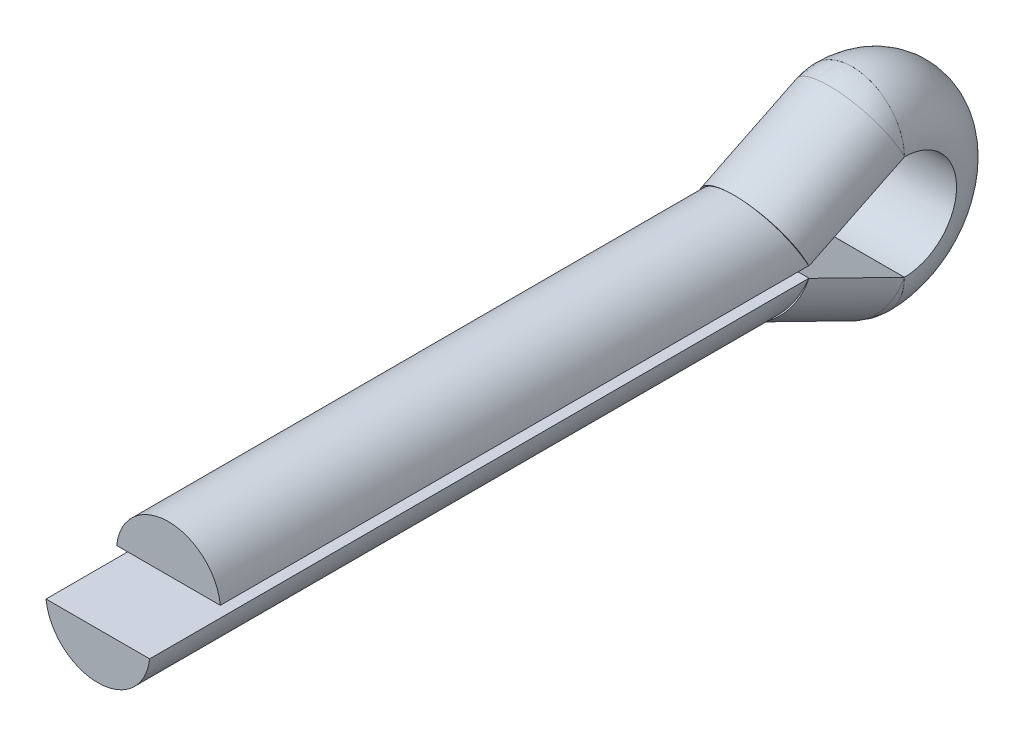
ISO-10303-21;
HEADER;
FILE_DESCRIPTION(('STEP AP214'),'2;1');
FILE_NAME('part.step','',(''),(''),'','','');
FILE_SCHEMA(('AUTOMOTIVE_DESIGN { 1 0 10303 214 1 1 1 1 }'));
ENDSEC;
DATA;
#1=APPLICATION_CONTEXT('core data for automotive mechanical design processes');
#2=APPLICATION_PROTOCOL_DEFINITION('international standard','automotive_design',2000,#1);
#3=PRODUCT_CONTEXT('',#1,'mechanical');
#4=PRODUCT('Part','Part','',(#3));
#5=PRODUCT_RELATED_PRODUCT_CATEGORY('part','',(#4));
#6=PRODUCT_DEFINITION_FORMATION('','',#4);
#7=PRODUCT_DEFINITION_CONTEXT('part definition',#1,'design');
#8=PRODUCT_DEFINITION('design','',#6,#7);
#9=PRODUCT_DEFINITION_SHAPE('','',#8);
#10=(LENGTH_UNIT() NAMED_UNIT(*) SI_UNIT(.MILLI.,.METRE.));
#11=(NAMED_UNIT(*) PLANE_ANGLE_UNIT() SI_UNIT($,.RADIAN.));
#12=(NAMED_UNIT(*) SI_UNIT($,.STERADIAN.) SOLID_ANGLE_UNIT());
#13=UNCERTAINTY_MEASURE_WITH_UNIT(LENGTH_MEASURE(1.E-05),#10,'distance_accuracy_value','');
#14=(GEOMETRIC_REPRESENTATION_CONTEXT(3) GLOBAL_UNCERTAINTY_ASSIGNED_CONTEXT((#13)) GLOBAL_UNIT_ASSIGNED_CONTEXT((#10,
#11,#12)) REPRESENTATION_CONTEXT('',''));
#15=CARTESIAN_POINT('',(0.,0.,0.));
#16=DIRECTION('',(0.,0.,1.));
#17=DIRECTION('',(1.,0.,0.));
#18=AXIS2_PLACEMENT_3D('',#15,#16,#17);
#19=CARTESIAN_POINT('',(0.,0.,32.));
#20=DIRECTION('',(0.,0.,-1.));
#21=DIRECTION('',(-1.,0.,0.));
#22=AXIS2_PLACEMENT_3D('',#19,#20,#21);
#23=CYLINDRICAL_SURFACE('',#22,2.95);
#24=CARTESIAN_POINT('',(0.,0.,36.));
#25=DIRECTION('',(0.,0.,1.));
#26=DIRECTION('',(-1.,0.,0.));
#27=AXIS2_PLACEMENT_3D('',#24,#25,#26);
#28=CIRCLE('',#27,2.95);
#29=CARTESIAN_POINT('',(-2.93357573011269,-0.310859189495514,36.));
#30=VERTEX_POINT('',#29);
#31=CARTESIAN_POINT('',(2.9335757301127,-0.310859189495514,36.));
#32=VERTEX_POINT('',#31);
#33=EDGE_CURVE('E177',#30,#32,#28,.T.);
#34=ORIENTED_EDGE('',*,*,#33,.F.);
#35=DIRECTION('',(0.,0.,-1.));
#36=VECTOR('',#35,1.);
#37=CARTESIAN_POINT('',(-2.93357573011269,-0.310859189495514,32.));
#38=LINE('',#37,#36);
#39=CARTESIAN_POINT('',(-2.93357573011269,-0.310859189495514,-1.29421159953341));
#40=VERTEX_POINT('',#39);
#41=EDGE_CURVE('E48',#30,#40,#38,.T.);
#42=ORIENTED_EDGE('',*,*,#41,.T.);
#43=CARTESIAN_POINT('',(0.,0.,-1.44665423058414));
#44=DIRECTION('',(0.,0.440298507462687,0.897851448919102));
#45=DIRECTION('',(0.,0.897851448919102,-0.440298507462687));
#46=AXIS2_PLACEMENT_3D('',#43,#44,#45);
#47=ELLIPSE('',#46,3.28562147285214,2.95);
#48=CARTESIAN_POINT('',(2.93357573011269,-0.310859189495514,-1.29421159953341));
#49=VERTEX_POINT('',#48);
#50=EDGE_CURVE('E174',#49,#40,#47,.F.);
#51=ORIENTED_EDGE('',*,*,#50,.F.);
#52=DIRECTION('',(0.,0.,-1.));
#53=VECTOR('',#52,1.);
#54=CARTESIAN_POINT('',(2.93357573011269,-0.310859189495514,32.));
#55=LINE('',#54,#53);
#56=EDGE_CURVE('E168',#49,#32,#55,.F.);
#57=ORIENTED_EDGE('',*,*,#56,.T.);
#58=EDGE_LOOP('',(#34,#42,#51,#57));
#59=FACE_BOUND('',#58,.T.);
#60=ADVANCED_FACE('F15',(#59),#23,.T.);
#61=CARTESIAN_POINT('',(0.,0.,32.));
#62=DIRECTION('',(0.,0.,1.));
#63=DIRECTION('',(1.,0.,0.));
#64=AXIS2_PLACEMENT_3D('',#61,#62,#63);
#65=PLANE('',#64);
#66=DIRECTION('',(-1.,0.,0.));
#67=VECTOR('',#66,1.);
#68=CARTESIAN_POINT('',(0.,0.310859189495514,32.));
#69=LINE('',#68,#67);
#70=CARTESIAN_POINT('',(2.93357573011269,0.310859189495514,32.));
#71=VERTEX_POINT('',#70);
#72=CARTESIAN_POINT('',(-2.93357573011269,0.310859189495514,32.));
#73=VERTEX_POINT('',#72);
#74=EDGE_CURVE('E327',#71,#73,#69,.T.);
#75=ORIENTED_EDGE('',*,*,#74,.F.);
#76=CARTESIAN_POINT('',(0.,0.,32.));
#77=DIRECTION('',(0.,0.,1.));
#78=DIRECTION('',(1.,0.,0.));
#79=AXIS2_PLACEMENT_3D('',#76,#77,#78);
#80=CIRCLE('',#79,2.95);
#81=EDGE_CURVE('E282',#71,#73,#80,.T.);
#82=ORIENTED_EDGE('',*,*,#81,.T.);
#83=EDGE_LOOP('',(#75,#82));
#84=FACE_BOUND('',#83,.T.);
#85=ADVANCED_FACE('F348',(#84),#65,.T.);
#86=CARTESIAN_POINT('',(2.949,-0.302236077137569,-1.29844029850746));
#87=DIRECTION('',(0.,-0.897851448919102,0.440298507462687));
#88=DIRECTION('',(0.,0.440298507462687,0.897851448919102));
#89=AXIS2_PLACEMENT_3D('',#86,#87,#88);
#90=PLANE('',#89);
#91=DIRECTION('',(0.,-0.440298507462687,-0.897851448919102));
#92=VECTOR('',#91,1.);
#93=CARTESIAN_POINT('',(-2.951,-0.302236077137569,-1.29844029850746));
#94=LINE('',#93,#92);
#95=CARTESIAN_POINT('',(-2.951,-0.310859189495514,-1.31602444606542));
#96=VERTEX_POINT('',#95);
#97=CARTESIAN_POINT('',(-2.951,-2.95089785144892,-6.69955970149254));
#98=VERTEX_POINT('',#97);
#99=EDGE_CURVE('E204',#96,#98,#94,.T.);
#100=ORIENTED_EDGE('',*,*,#99,.F.);
#101=DIRECTION('',(1.,0.,0.));
#102=VECTOR('',#101,1.);
#103=CARTESIAN_POINT('',(2.949,-0.310859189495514,-1.31602444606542));
#104=LINE('',#103,#102);
#105=CARTESIAN_POINT('',(2.949,-0.310859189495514,-1.31602444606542));
#106=VERTEX_POINT('',#105);
#107=EDGE_CURVE('E315',#96,#106,#104,.T.);
#108=ORIENTED_EDGE('',*,*,#107,.T.);
#109=DIRECTION('',(0.,-0.440298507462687,-0.897851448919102));
#110=VECTOR('',#109,1.);
#111=CARTESIAN_POINT('',(2.949,-0.302236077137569,-1.29844029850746));
#112=LINE('',#111,#110);
#113=CARTESIAN_POINT('',(2.949,-2.95089785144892,-6.69955970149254));
#114=VERTEX_POINT('',#113);
#115=EDGE_CURVE('E207',#106,#114,#112,.T.);
#116=ORIENTED_EDGE('',*,*,#115,.T.);
#117=DIRECTION('',(-1.,0.,0.));
#118=VECTOR('',#117,1.);
#119=CARTESIAN_POINT('',(2.949,-2.95089785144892,-6.69955970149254));
#120=LINE('',#119,#118);
#121=CARTESIAN_POINT('',(2.94704983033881,-2.95089785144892,-6.69955970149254));
#122=VERTEX_POINT('',#121);
#123=EDGE_CURVE('E197',#114,#122,#120,.T.);
#124=ORIENTED_EDGE('',*,*,#123,.T.);
#125=DIRECTION('',(1.,0.,0.));
#126=VECTOR('',#125,1.);
#127=CARTESIAN_POINT('',(0.,-2.95089785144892,-6.69955970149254));
#128=LINE('',#127,#126);
#129=CARTESIAN_POINT('',(-2.94704983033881,-2.95089785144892,-6.69955970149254));
#130=VERTEX_POINT('',#129);
#131=EDGE_CURVE('E290',#130,#122,#128,.T.);
#132=ORIENTED_EDGE('',*,*,#131,.F.);
#133=EDGE_CURVE('E189',#130,#98,#120,.T.);
#134=ORIENTED_EDGE('',*,*,#133,.T.);
#135=EDGE_LOOP('',(#100,#108,#116,#124,#132,#134));
#136=FACE_BOUND('',#135,.T.);
#137=ADVANCED_FACE('F350',(#136),#90,.F.);
#138=CARTESIAN_POINT('',(-0.00100000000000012,-0.302236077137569,-1.29844029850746));
#139=DIRECTION('',(0.,0.440298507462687,0.897851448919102));
#140=DIRECTION('',(-1.,0.,0.));
#141=AXIS2_PLACEMENT_3D('',#138,#139,#140);
#142=PLANE('',#141);
#143=DIRECTION('',(1.,0.,0.));
#144=VECTOR('',#143,1.);
#145=CARTESIAN_POINT('',(-0.00100000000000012,-0.310859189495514,-1.29421159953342));
#146=LINE('',#145,#144);
#147=CARTESIAN_POINT('',(-2.95098436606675,-0.310859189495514,-1.29421159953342));
#148=VERTEX_POINT('',#147);
#149=EDGE_CURVE('E299',#148,#40,#146,.T.);
#150=ORIENTED_EDGE('',*,*,#149,.F.);
#151=CARTESIAN_POINT('',(-0.00100000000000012,-0.302236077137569,-1.29844029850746));
#152=DIRECTION('',(0.,0.440298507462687,0.897851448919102));
#153=DIRECTION('',(-1.,0.,0.));
#154=AXIS2_PLACEMENT_3D('',#151,#152,#153);
#155=CIRCLE('',#154,2.95);
#156=CARTESIAN_POINT('',(2.94898436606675,-0.310859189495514,-1.29421159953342));
#157=VERTEX_POINT('',#156);
#158=EDGE_CURVE('E199',#148,#157,#155,.T.);
#159=ORIENTED_EDGE('',*,*,#158,.T.);
#160=EDGE_CURVE('E301',#49,#157,#146,.T.);
#161=ORIENTED_EDGE('',*,*,#160,.F.);
#162=ORIENTED_EDGE('',*,*,#50,.T.);
#163=EDGE_LOOP('',(#150,#159,#161,#162));
#164=FACE_BOUND('',#163,.T.);
#165=ADVANCED_FACE('F298',(#164),#142,.T.);
#166=CARTESIAN_POINT('',(0.,-2.95,-6.7));
#167=DIRECTION('',(0.,0.440298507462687,0.897851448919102));
#168=DIRECTION('',(-1.,0.,0.));
#169=AXIS2_PLACEMENT_3D('',#166,#167,#168);
#170=PLANE('',#169);
#171=CARTESIAN_POINT('',(0.,-2.95,-6.7));
#172=DIRECTION('',(0.,0.440298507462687,0.897851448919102));
#173=DIRECTION('',(-1.,0.,0.));
#174=AXIS2_PLACEMENT_3D('',#171,#172,#173);
#175=CIRCLE('',#174,2.94705);
#176=CARTESIAN_POINT('',(-2.94705,-2.95,-6.7));
#177=VERTEX_POINT('',#176);
#178=EDGE_CURVE('E220',#177,#130,#175,.T.);
#179=ORIENTED_EDGE('',*,*,#178,.T.);
#180=ORIENTED_EDGE('',*,*,#131,.T.);
#181=CARTESIAN_POINT('',(2.94705,-2.95,-6.7));
#182=VERTEX_POINT('',#181);
#183=EDGE_CURVE('E214',#122,#182,#175,.T.);
#184=ORIENTED_EDGE('',*,*,#183,.T.);
#185=DIRECTION('',(-1.,0.,0.));
#186=VECTOR('',#185,1.);
#187=CARTESIAN_POINT('',(2.94705,-2.95,-6.7));
#188=LINE('',#187,#186);
#189=EDGE_CURVE('E215',#182,#177,#188,.T.);
#190=ORIENTED_EDGE('',*,*,#189,.T.);
#191=EDGE_LOOP('',(#179,#180,#184,#190));
#192=FACE_BOUND('',#191,.T.);
#193=ADVANCED_FACE('F392',(#192),#170,.T.);
#194=CARTESIAN_POINT('',(0.,-2.95,-6.7));
#195=DIRECTION('',(0.,0.,-1.));
#196=DIRECTION('',(1.,0.,0.));
#197=AXIS2_PLACEMENT_3D('',#194,#195,#196);
#198=PLANE('',#197);
#199=CARTESIAN_POINT('',(0.,-2.95,-6.7));
#200=DIRECTION('',(0.,0.,1.));
#201=DIRECTION('',(-1.,0.,0.));
#202=AXIS2_PLACEMENT_3D('',#199,#200,#201);
#203=CIRCLE('',#202,2.94705);
#204=EDGE_CURVE('E210',#177,#182,#203,.T.);
#205=ORIENTED_EDGE('',*,*,#204,.F.);
#206=DIRECTION('',(1.,0.,0.));
#207=VECTOR('',#206,1.);
#208=CARTESIAN_POINT('',(-2.95,-2.95,-6.7));
#209=LINE('',#208,#207);
#210=CARTESIAN_POINT('',(-2.95,-2.95,-6.7));
#211=VERTEX_POINT('',#210);
#212=EDGE_CURVE('E234',#211,#177,#209,.T.);
#213=ORIENTED_EDGE('',*,*,#212,.F.);
#214=CARTESIAN_POINT('',(0.,-2.95,-6.7));
#215=DIRECTION('',(0.,0.,-1.));
#216=DIRECTION('',(1.,0.,0.));
#217=AXIS2_PLACEMENT_3D('',#214,#215,#216);
#218=CIRCLE('',#217,2.95);
#219=CARTESIAN_POINT('',(2.95,-2.95,-6.7));
#220=VERTEX_POINT('',#219);
#221=EDGE_CURVE('E229',#220,#211,#218,.T.);
#222=ORIENTED_EDGE('',*,*,#221,.F.);
#223=EDGE_CURVE('E239',#182,#220,#209,.T.);
#224=ORIENTED_EDGE('',*,*,#223,.F.);
#225=EDGE_LOOP('',(#205,#213,#222,#224));
#226=FACE_BOUND('',#225,.T.);
#227=ADVANCED_FACE('F389',(#226),#198,.F.);
#228=ORIENTED_EDGE('',*,*,#81,.F.);
#229=DIRECTION('',(0.,0.,-1.));
#230=VECTOR('',#229,1.);
#231=CARTESIAN_POINT('',(2.93357573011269,0.310859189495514,32.));
#232=LINE('',#231,#230);
#233=CARTESIAN_POINT('',(2.93357573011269,0.310859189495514,-1.29421159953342));
#234=VERTEX_POINT('',#233);
#235=EDGE_CURVE('E324',#71,#234,#232,.T.);
#236=ORIENTED_EDGE('',*,*,#235,.T.);
#237=CARTESIAN_POINT('',(0.,0.,-1.44665423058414));
#238=DIRECTION('',(0.,-0.440298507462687,0.897851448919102));
#239=DIRECTION('',(0.,-0.897851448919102,-0.440298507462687));
#240=AXIS2_PLACEMENT_3D('',#237,#238,#239);
#241=ELLIPSE('',#240,3.28562147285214,2.95);
#242=CARTESIAN_POINT('',(-2.93357573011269,0.310859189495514,-1.29421159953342));
#243=VERTEX_POINT('',#242);
#244=EDGE_CURVE('E286',#234,#243,#241,.T.);
#245=ORIENTED_EDGE('',*,*,#244,.T.);
#246=DIRECTION('',(0.,0.,-1.));
#247=VECTOR('',#246,1.);
#248=CARTESIAN_POINT('',(-2.93357573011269,0.310859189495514,32.));
#249=LINE('',#248,#247);
#250=EDGE_CURVE('E183',#243,#73,#249,.F.);
#251=ORIENTED_EDGE('',*,*,#250,.T.);
#252=EDGE_LOOP('',(#228,#236,#245,#251));
#253=FACE_BOUND('',#252,.T.);
#254=ADVANCED_FACE('F17',(#253),#23,.T.);
#255=CARTESIAN_POINT('',(0.000999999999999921,0.302236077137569,-1.29844029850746));
#256=DIRECTION('',(0.,-0.440298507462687,0.897851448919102));
#257=DIRECTION('',(1.,0.,0.));
#258=AXIS2_PLACEMENT_3D('',#255,#256,#257);
#259=PLANE('',#258);
#260=DIRECTION('',(-1.,0.,0.));
#261=VECTOR('',#260,1.);
#262=CARTESIAN_POINT('',(0.000999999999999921,0.310859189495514,-1.29421159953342));
#263=LINE('',#262,#261);
#264=CARTESIAN_POINT('',(2.95098436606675,0.310859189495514,-1.29421159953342));
#265=VERTEX_POINT('',#264);
#266=EDGE_CURVE('E321',#265,#234,#263,.T.);
#267=ORIENTED_EDGE('',*,*,#266,.F.);
#268=CARTESIAN_POINT('',(0.000999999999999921,0.302236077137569,-1.29844029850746));
#269=DIRECTION('',(0.,-0.440298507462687,0.897851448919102));
#270=DIRECTION('',(1.,0.,0.));
#271=AXIS2_PLACEMENT_3D('',#268,#269,#270);
#272=CIRCLE('',#271,2.95);
#273=CARTESIAN_POINT('',(-2.94898436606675,0.310859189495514,-1.29421159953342));
#274=VERTEX_POINT('',#273);
#275=EDGE_CURVE('E268',#265,#274,#272,.T.);
#276=ORIENTED_EDGE('',*,*,#275,.T.);
#277=EDGE_CURVE('E193',#243,#274,#263,.T.);
#278=ORIENTED_EDGE('',*,*,#277,.F.);
#279=ORIENTED_EDGE('',*,*,#244,.F.);
#280=EDGE_LOOP('',(#267,#276,#278,#279));
#281=FACE_BOUND('',#280,.T.);
#282=ADVANCED_FACE('F344',(#281),#259,.T.);
#283=CARTESIAN_POINT('',(-2.949,0.302236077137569,-1.29844029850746));
#284=DIRECTION('',(0.,0.897851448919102,0.440298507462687));
#285=DIRECTION('',(0.,-0.440298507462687,0.897851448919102));
#286=AXIS2_PLACEMENT_3D('',#283,#284,#285);
#287=PLANE('',#286);
#288=DIRECTION('',(0.,0.440298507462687,-0.897851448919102));
#289=VECTOR('',#288,1.);
#290=CARTESIAN_POINT('',(2.951,0.302236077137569,-1.29844029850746));
#291=LINE('',#290,#289);
#292=CARTESIAN_POINT('',(2.951,0.310859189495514,-1.31602444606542));
#293=VERTEX_POINT('',#292);
#294=CARTESIAN_POINT('',(2.951,2.95089785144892,-6.69955970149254));
#295=VERTEX_POINT('',#294);
#296=EDGE_CURVE('E277',#293,#295,#291,.T.);
#297=ORIENTED_EDGE('',*,*,#296,.F.);
#298=DIRECTION('',(-1.,0.,0.));
#299=VECTOR('',#298,1.);
#300=CARTESIAN_POINT('',(-2.949,0.310859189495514,-1.31602444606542));
#301=LINE('',#300,#299);
#302=CARTESIAN_POINT('',(-2.949,0.310859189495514,-1.31602444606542));
#303=VERTEX_POINT('',#302);
#304=EDGE_CURVE('E36',#293,#303,#301,.T.);
#305=ORIENTED_EDGE('',*,*,#304,.T.);
#306=DIRECTION('',(0.,0.440298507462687,-0.897851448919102));
#307=VECTOR('',#306,1.);
#308=CARTESIAN_POINT('',(-2.949,0.302236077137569,-1.29844029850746));
#309=LINE('',#308,#307);
#310=CARTESIAN_POINT('',(-2.949,2.95089785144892,-6.69955970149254));
#311=VERTEX_POINT('',#310);
#312=EDGE_CURVE('E279',#303,#311,#309,.T.);
#313=ORIENTED_EDGE('',*,*,#312,.T.);
#314=DIRECTION('',(1.,0.,0.));
#315=VECTOR('',#314,1.);
#316=CARTESIAN_POINT('',(-2.949,2.95089785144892,-6.69955970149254));
#317=LINE('',#316,#315);
#318=CARTESIAN_POINT('',(-2.94704983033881,2.95089785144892,-6.69955970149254));
#319=VERTEX_POINT('',#318);
#320=EDGE_CURVE('E264',#311,#319,#317,.T.);
#321=ORIENTED_EDGE('',*,*,#320,.T.);
#322=CARTESIAN_POINT('',(2.94704983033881,2.95089785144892,-6.69955970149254));
#323=VERTEX_POINT('',#322);
#324=EDGE_CURVE('E269',#319,#323,#317,.T.);
#325=ORIENTED_EDGE('',*,*,#324,.T.);
#326=EDGE_CURVE('E270',#323,#295,#317,.T.);
#327=ORIENTED_EDGE('',*,*,#326,.T.);
#328=EDGE_LOOP('',(#297,#305,#313,#321,#325,#327));
#329=FACE_BOUND('',#328,.T.);
#330=ADVANCED_FACE('F362',(#329),#287,.F.);
#331=CARTESIAN_POINT('',(0.000999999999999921,0.302236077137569,-1.29844029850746));
#332=DIRECTION('',(0.,0.440298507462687,-0.897851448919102));
#333=DIRECTION('',(-1.,0.,0.));
#334=AXIS2_PLACEMENT_3D('',#331,#332,#333);
#335=CYLINDRICAL_SURFACE('',#334,2.95);
#336=ORIENTED_EDGE('',*,*,#312,.F.);
#337=CARTESIAN_POINT('',(0.000999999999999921,0.310859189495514,-1.31602444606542));
#338=DIRECTION('',(0.,1.,0.));
#339=DIRECTION('',(0.,0.,-1.));
#340=AXIS2_PLACEMENT_3D('',#337,#338,#339);
#341=ELLIPSE('',#340,6.7,2.95);
#342=EDGE_CURVE('E10',#303,#274,#341,.T.);
#343=ORIENTED_EDGE('',*,*,#342,.T.);
#344=ORIENTED_EDGE('',*,*,#275,.F.);
#345=EDGE_CURVE('E19',#265,#293,#341,.T.);
#346=ORIENTED_EDGE('',*,*,#345,.T.);
#347=ORIENTED_EDGE('',*,*,#296,.T.);
#348=CARTESIAN_POINT('',(0.000999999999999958,2.95089785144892,-6.69955970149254));
#349=DIRECTION('',(0.,-0.440298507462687,0.897851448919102));
#350=DIRECTION('',(1.,0.,0.));
#351=AXIS2_PLACEMENT_3D('',#348,#349,#350);
#352=CIRCLE('',#351,2.95);
#353=EDGE_CURVE('E258',#295,#311,#352,.T.);
#354=ORIENTED_EDGE('',*,*,#353,.T.);
#355=EDGE_LOOP('',(#336,#343,#344,#346,#347,#354));
#356=FACE_BOUND('',#355,.T.);
#357=ADVANCED_FACE('F342',(#356),#335,.T.);
#358=CARTESIAN_POINT('',(0.000999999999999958,2.95089785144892,-6.69955970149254));
#359=DIRECTION('',(0.,-0.440298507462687,0.897851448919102));
#360=DIRECTION('',(1.,0.,0.));
#361=AXIS2_PLACEMENT_3D('',#358,#359,#360);
#362=PLANE('',#361);
#363=ORIENTED_EDGE('',*,*,#326,.F.);
#364=CARTESIAN_POINT('',(0.,2.95,-6.7));
#365=DIRECTION('',(0.,-0.440298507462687,0.897851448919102));
#366=DIRECTION('',(1.,0.,0.));
#367=AXIS2_PLACEMENT_3D('',#364,#365,#366);
#368=CIRCLE('',#367,2.94705);
#369=EDGE_CURVE('E263',#323,#319,#368,.T.);
#370=ORIENTED_EDGE('',*,*,#369,.T.);
#371=ORIENTED_EDGE('',*,*,#320,.F.);
#372=ORIENTED_EDGE('',*,*,#353,.F.);
#373=EDGE_LOOP('',(#363,#370,#371,#372));
#374=FACE_BOUND('',#373,.T.);
#375=ADVANCED_FACE('F361',(#374),#362,.F.);
#376=CARTESIAN_POINT('',(0.,2.95,-6.7));
#377=DIRECTION('',(0.,-0.440298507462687,0.897851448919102));
#378=DIRECTION('',(1.,0.,0.));
#379=AXIS2_PLACEMENT_3D('',#376,#377,#378);
#380=PLANE('',#379);
#381=ORIENTED_EDGE('',*,*,#324,.F.);
#382=CARTESIAN_POINT('',(-2.94705,2.95,-6.7));
#383=VERTEX_POINT('',#382);
#384=EDGE_CURVE('E253',#319,#383,#368,.T.);
#385=ORIENTED_EDGE('',*,*,#384,.T.);
#386=DIRECTION('',(1.,0.,0.));
#387=VECTOR('',#386,1.);
#388=CARTESIAN_POINT('',(-2.94705,2.95,-6.7));
#389=LINE('',#388,#387);
#390=CARTESIAN_POINT('',(2.94705,2.95,-6.7));
#391=VERTEX_POINT('',#390);
#392=EDGE_CURVE('E254',#383,#391,#389,.T.);
#393=ORIENTED_EDGE('',*,*,#392,.T.);
#394=EDGE_CURVE('E259',#391,#323,#368,.T.);
#395=ORIENTED_EDGE('',*,*,#394,.T.);
#396=EDGE_LOOP('',(#381,#385,#393,#395));
#397=FACE_BOUND('',#396,.T.);
#398=ADVANCED_FACE('F370',(#397),#380,.T.);
#399=CARTESIAN_POINT('',(0.,2.95,-6.7));
#400=DIRECTION('',(-1.,0.,0.));
#401=DIRECTION('',(0.,0.897851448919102,0.440298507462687));
#402=AXIS2_PLACEMENT_3D('',#399,#400,#401);
#403=SPHERICAL_SURFACE('',#402,2.94705);
#404=CARTESIAN_POINT('',(0.,2.95,-6.7));
#405=DIRECTION('',(0.,0.,1.));
#406=DIRECTION('',(1.,0.,0.));
#407=AXIS2_PLACEMENT_3D('',#404,#405,#406);
#408=CIRCLE('',#407,2.94705);
#409=EDGE_CURVE('E249',#391,#383,#408,.T.);
#410=ORIENTED_EDGE('',*,*,#409,.T.);
#411=ORIENTED_EDGE('',*,*,#384,.F.);
#412=ORIENTED_EDGE('',*,*,#369,.F.);
#413=ORIENTED_EDGE('',*,*,#394,.F.);
#414=EDGE_LOOP('',(#410,#411,#412,#413));
#415=FACE_BOUND('',#414,.T.);
#416=ADVANCED_FACE('F372',(#415),#403,.T.);
#417=CARTESIAN_POINT('',(0.,2.95,-6.7));
#418=DIRECTION('',(0.,0.,1.));
#419=DIRECTION('',(1.,0.,0.));
#420=AXIS2_PLACEMENT_3D('',#417,#418,#419);
#421=PLANE('',#420);
#422=ORIENTED_EDGE('',*,*,#409,.F.);
#423=DIRECTION('',(1.,0.,0.));
#424=VECTOR('',#423,1.);
#425=CARTESIAN_POINT('',(-2.95,2.95,-6.7));
#426=LINE('',#425,#424);
#427=CARTESIAN_POINT('',(2.95,2.95,-6.7));
#428=VERTEX_POINT('',#427);
#429=EDGE_CURVE('E230',#391,#428,#426,.T.);
#430=ORIENTED_EDGE('',*,*,#429,.T.);
#431=CARTESIAN_POINT('',(0.,2.95,-6.7));
#432=DIRECTION('',(0.,0.,1.));
#433=DIRECTION('',(1.,0.,0.));
#434=AXIS2_PLACEMENT_3D('',#431,#432,#433);
#435=CIRCLE('',#434,2.95);
#436=CARTESIAN_POINT('',(-2.95,2.95,-6.7));
#437=VERTEX_POINT('',#436);
#438=EDGE_CURVE('E219',#428,#437,#435,.T.);
#439=ORIENTED_EDGE('',*,*,#438,.T.);
#440=EDGE_CURVE('E225',#437,#383,#426,.T.);
#441=ORIENTED_EDGE('',*,*,#440,.T.);
#442=EDGE_LOOP('',(#422,#430,#439,#441));
#443=FACE_BOUND('',#442,.T.);
#444=ADVANCED_FACE('F375',(#443),#421,.T.);
#445=CARTESIAN_POINT('',(0.,0.,-6.7));
#446=DIRECTION('',(1.,0.,0.));
#447=DIRECTION('',(0.,0.,-1.));
#448=AXIS2_PLACEMENT_3D('',#445,#446,#447);
#449=DEGENERATE_TOROIDAL_SURFACE('',#448,2.95,2.95,.T.);
#450=CARTESIAN_POINT('',(-2.95,0.,-6.7));
#451=DIRECTION('',(1.,0.,0.));
#452=DIRECTION('',(0.,0.,-1.));
#453=AXIS2_PLACEMENT_3D('',#450,#451,#452);
#454=CIRCLE('',#453,2.95);
#455=EDGE_CURVE('E246',#211,#437,#454,.T.);
#456=ORIENTED_EDGE('',*,*,#455,.T.);
#457=ORIENTED_EDGE('',*,*,#438,.F.);
#458=CARTESIAN_POINT('',(2.95,0.,-6.7));
#459=DIRECTION('',(1.,0.,0.));
#460=DIRECTION('',(0.,0.,-1.));
#461=AXIS2_PLACEMENT_3D('',#458,#459,#460);
#462=CIRCLE('',#461,2.95);
#463=EDGE_CURVE('E238',#220,#428,#462,.T.);
#464=ORIENTED_EDGE('',*,*,#463,.F.);
#465=ORIENTED_EDGE('',*,*,#221,.T.);
#466=EDGE_LOOP('',(#456,#457,#464,#465));
#467=FACE_BOUND('',#466,.T.);
#468=ADVANCED_FACE('F384',(#467),#449,.T.);
#469=CARTESIAN_POINT('',(1.,0.,-6.7));
#470=DIRECTION('',(1.,0.,0.));
#471=DIRECTION('',(0.,0.,-1.));
#472=AXIS2_PLACEMENT_3D('',#469,#470,#471);
#473=CYLINDRICAL_SURFACE('',#472,2.95);
#474=ORIENTED_EDGE('',*,*,#212,.T.);
#475=ORIENTED_EDGE('',*,*,#189,.F.);
#476=ORIENTED_EDGE('',*,*,#223,.T.);
#477=ORIENTED_EDGE('',*,*,#463,.T.);
#478=ORIENTED_EDGE('',*,*,#429,.F.);
#479=ORIENTED_EDGE('',*,*,#392,.F.);
#480=ORIENTED_EDGE('',*,*,#440,.F.);
#481=ORIENTED_EDGE('',*,*,#455,.F.);
#482=EDGE_LOOP('',(#474,#475,#476,#477,#478,#479,#480,#481));
#483=FACE_BOUND('',#482,.T.);
#484=ADVANCED_FACE('F380',(#483),#473,.F.);
#485=CARTESIAN_POINT('',(0.,-2.95,-6.7));
#486=DIRECTION('',(1.,0.,0.));
#487=DIRECTION('',(0.,-0.897851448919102,0.440298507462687));
#488=AXIS2_PLACEMENT_3D('',#485,#486,#487);
#489=SPHERICAL_SURFACE('',#488,2.94705);
#490=ORIENTED_EDGE('',*,*,#204,.T.);
#491=ORIENTED_EDGE('',*,*,#183,.F.);
#492=EDGE_CURVE('E224',#130,#122,#175,.T.);
#493=ORIENTED_EDGE('',*,*,#492,.F.);
#494=ORIENTED_EDGE('',*,*,#178,.F.);
#495=EDGE_LOOP('',(#490,#491,#493,#494));
#496=FACE_BOUND('',#495,.T.);
#497=ADVANCED_FACE('F383',(#496),#489,.T.);
#498=CARTESIAN_POINT('',(-0.00100000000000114,-2.95089785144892,-6.69955970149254));
#499=DIRECTION('',(0.,0.440298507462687,0.897851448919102));
#500=DIRECTION('',(-1.,0.,0.));
#501=AXIS2_PLACEMENT_3D('',#498,#499,#500);
#502=PLANE('',#501);
#503=ORIENTED_EDGE('',*,*,#133,.F.);
#504=ORIENTED_EDGE('',*,*,#492,.T.);
#505=ORIENTED_EDGE('',*,*,#123,.F.);
#506=CARTESIAN_POINT('',(-0.00100000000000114,-2.95089785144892,-6.69955970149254));
#507=DIRECTION('',(0.,0.440298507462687,0.897851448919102));
#508=DIRECTION('',(-1.,0.,0.));
#509=AXIS2_PLACEMENT_3D('',#506,#507,#508);
#510=CIRCLE('',#509,2.95);
#511=EDGE_CURVE('E182',#98,#114,#510,.T.);
#512=ORIENTED_EDGE('',*,*,#511,.F.);
#513=EDGE_LOOP('',(#503,#504,#505,#512));
#514=FACE_BOUND('',#513,.T.);
#515=ADVANCED_FACE('F399',(#514),#502,.F.);
#516=CARTESIAN_POINT('',(-0.00100000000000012,-0.302236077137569,-1.29844029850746));
#517=DIRECTION('',(0.,-0.440298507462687,-0.897851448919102));
#518=DIRECTION('',(1.,0.,0.));
#519=AXIS2_PLACEMENT_3D('',#516,#517,#518);
#520=CYLINDRICAL_SURFACE('',#519,2.95);
#521=ORIENTED_EDGE('',*,*,#115,.F.);
#522=CARTESIAN_POINT('',(-0.00100000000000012,-0.310859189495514,-1.31602444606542));
#523=DIRECTION('',(0.,-1.,0.));
#524=DIRECTION('',(0.,0.,-1.));
#525=AXIS2_PLACEMENT_3D('',#522,#523,#524);
#526=ELLIPSE('',#525,6.7,2.95);
#527=EDGE_CURVE('E314',#106,#157,#526,.T.);
#528=ORIENTED_EDGE('',*,*,#527,.T.);
#529=ORIENTED_EDGE('',*,*,#158,.F.);
#530=EDGE_CURVE('E308',#148,#96,#526,.T.);
#531=ORIENTED_EDGE('',*,*,#530,.T.);
#532=ORIENTED_EDGE('',*,*,#99,.T.);
#533=ORIENTED_EDGE('',*,*,#511,.T.);
#534=EDGE_LOOP('',(#521,#528,#529,#531,#532,#533));
#535=FACE_BOUND('',#534,.T.);
#536=ADVANCED_FACE('F404',(#535),#520,.T.);
#537=CARTESIAN_POINT('',(0.,0.,36.));
#538=DIRECTION('',(0.,0.,1.));
#539=DIRECTION('',(-1.,0.,0.));
#540=AXIS2_PLACEMENT_3D('',#537,#538,#539);
#541=PLANE('',#540);
#542=DIRECTION('',(1.,0.,0.));
#543=VECTOR('',#542,1.);
#544=CARTESIAN_POINT('',(0.,-0.310859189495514,36.));
#545=LINE('',#544,#543);
#546=EDGE_CURVE('E165',#30,#32,#545,.T.);
#547=ORIENTED_EDGE('',*,*,#546,.F.);
#548=ORIENTED_EDGE('',*,*,#33,.T.);
#549=EDGE_LOOP('',(#547,#548));
#550=FACE_BOUND('',#549,.T.);
#551=ADVANCED_FACE('F181',(#550),#541,.T.);
#552=CARTESIAN_POINT('',(5.9,-0.310859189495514,25.7));
#553=DIRECTION('',(0.,-1.,0.));
#554=DIRECTION('',(1.,0.,0.));
#555=AXIS2_PLACEMENT_3D('',#552,#553,#554);
#556=PLANE('',#555);
#557=ORIENTED_EDGE('',*,*,#530,.F.);
#558=ORIENTED_EDGE('',*,*,#149,.T.);
#559=ORIENTED_EDGE('',*,*,#41,.F.);
#560=ORIENTED_EDGE('',*,*,#546,.T.);
#561=ORIENTED_EDGE('',*,*,#56,.F.);
#562=ORIENTED_EDGE('',*,*,#160,.T.);
#563=ORIENTED_EDGE('',*,*,#527,.F.);
#564=ORIENTED_EDGE('',*,*,#107,.F.);
#565=EDGE_LOOP('',(#557,#558,#559,#560,#561,#562,#563,#564));
#566=FACE_BOUND('',#565,.T.);
#567=ADVANCED_FACE('F167',(#566),#556,.F.);
#568=CARTESIAN_POINT('',(5.9,0.310859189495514,25.7));
#569=DIRECTION('',(0.,1.,0.));
#570=DIRECTION('',(-1.,0.,0.));
#571=AXIS2_PLACEMENT_3D('',#568,#569,#570);
#572=PLANE('',#571);
#573=ORIENTED_EDGE('',*,*,#277,.T.);
#574=ORIENTED_EDGE('',*,*,#342,.F.);
#575=ORIENTED_EDGE('',*,*,#304,.F.);
#576=ORIENTED_EDGE('',*,*,#345,.F.);
#577=ORIENTED_EDGE('',*,*,#266,.T.);
#578=ORIENTED_EDGE('',*,*,#235,.F.);
#579=ORIENTED_EDGE('',*,*,#74,.T.);
#580=ORIENTED_EDGE('',*,*,#250,.F.);
#581=EDGE_LOOP('',(#573,#574,#575,#576,#577,#578,#579,#580));
#582=FACE_BOUND('',#581,.T.);
#583=ADVANCED_FACE('F336',(#582),#572,.F.);
#584=CLOSED_SHELL('',(#60,#85,#137,#165,#193,#227,#254,#282,#330,#357,#375,#398,#416,#444,#468,
#484,#497,#515,#536,#551,#567,#583));
#585=MANIFOLD_SOLID_BREP('B1',#584);
#586=ADVANCED_BREP_SHAPE_REPRESENTATION('',(#18,#585),#14);
#587=SHAPE_DEFINITION_REPRESENTATION(#9,#586);
ENDSEC;
END-ISO-10303-21;
